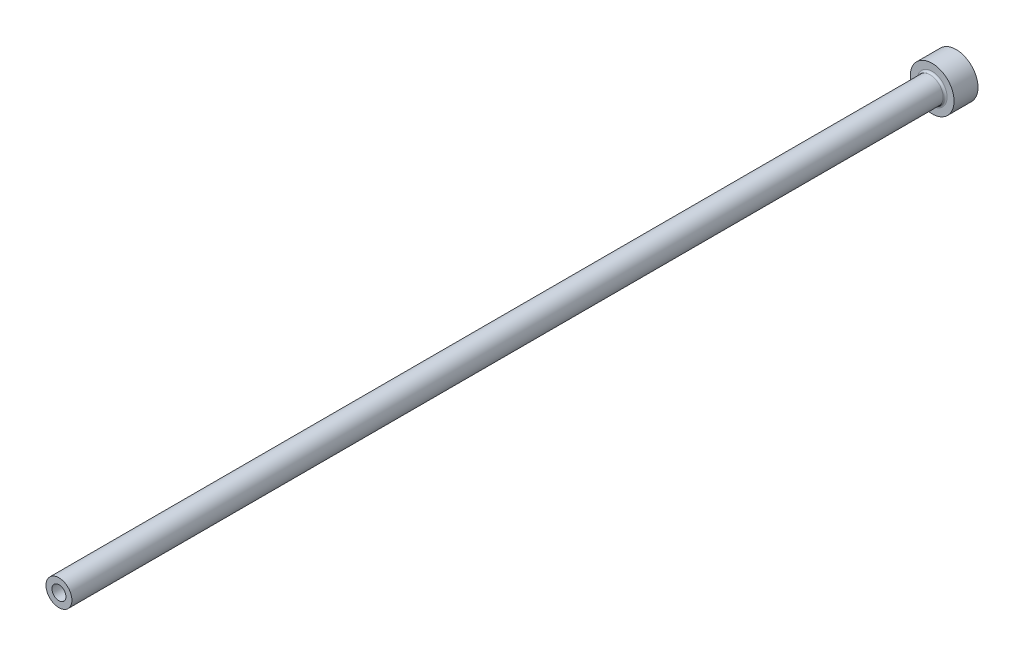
ISO-10303-21;
HEADER;
FILE_DESCRIPTION(('STEP AP214'),'2;1');
FILE_NAME('part.step','',(''),(''),'','','');
FILE_SCHEMA(('AUTOMOTIVE_DESIGN { 1 0 10303 214 1 1 1 1 }'));
ENDSEC;
DATA;
#1=APPLICATION_CONTEXT('core data for automotive mechanical design processes');
#2=APPLICATION_PROTOCOL_DEFINITION('international standard','automotive_design',2000,#1);
#3=PRODUCT_CONTEXT('',#1,'mechanical');
#4=PRODUCT('Part','Part','',(#3));
#5=PRODUCT_RELATED_PRODUCT_CATEGORY('part','',(#4));
#6=PRODUCT_DEFINITION_FORMATION('','',#4);
#7=PRODUCT_DEFINITION_CONTEXT('part definition',#1,'design');
#8=PRODUCT_DEFINITION('design','',#6,#7);
#9=PRODUCT_DEFINITION_SHAPE('','',#8);
#10=(LENGTH_UNIT() NAMED_UNIT(*) SI_UNIT(.MILLI.,.METRE.));
#11=(NAMED_UNIT(*) PLANE_ANGLE_UNIT() SI_UNIT($,.RADIAN.));
#12=(NAMED_UNIT(*) SI_UNIT($,.STERADIAN.) SOLID_ANGLE_UNIT());
#13=UNCERTAINTY_MEASURE_WITH_UNIT(LENGTH_MEASURE(1.E-05),#10,'distance_accuracy_value','');
#14=(GEOMETRIC_REPRESENTATION_CONTEXT(3) GLOBAL_UNCERTAINTY_ASSIGNED_CONTEXT((#13)) GLOBAL_UNIT_ASSIGNED_CONTEXT((#10,
#11,#12)) REPRESENTATION_CONTEXT('',''));
#15=CARTESIAN_POINT('',(0.,0.,0.));
#16=DIRECTION('',(0.,0.,1.));
#17=DIRECTION('',(1.,0.,0.));
#18=AXIS2_PLACEMENT_3D('',#15,#16,#17);
#19=CARTESIAN_POINT('',(0.,0.,225.));
#20=DIRECTION('',(0.,0.,-1.));
#21=DIRECTION('',(-1.,0.,0.));
#22=AXIS2_PLACEMENT_3D('',#19,#20,#21);
#23=PLANE('',#22);
#24=CARTESIAN_POINT('',(0.,0.,225.));
#25=DIRECTION('',(0.,0.,1.));
#26=DIRECTION('',(1.,0.,0.));
#27=AXIS2_PLACEMENT_3D('',#24,#25,#26);
#28=CIRCLE('',#27,1.74999999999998);
#29=CARTESIAN_POINT('',(1.74999999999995,0.,225.));
#30=VERTEX_POINT('',#29);
#31=EDGE_CURVE('E63',#30,#30,#28,.T.);
#32=ORIENTED_EDGE('',*,*,#31,.F.);
#33=EDGE_LOOP('',(#32));
#34=FACE_BOUND('',#33,.T.);
#35=CARTESIAN_POINT('',(0.,0.,225.));
#36=DIRECTION('',(0.,0.,1.));
#37=DIRECTION('',(1.,0.,0.));
#38=AXIS2_PLACEMENT_3D('',#35,#36,#37);
#39=CIRCLE('',#38,3.24999999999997);
#40=CARTESIAN_POINT('',(3.24999999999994,0.,225.));
#41=VERTEX_POINT('',#40);
#42=EDGE_CURVE('E54',#41,#41,#39,.T.);
#43=ORIENTED_EDGE('',*,*,#42,.T.);
#44=EDGE_LOOP('',(#43));
#45=FACE_BOUND('',#44,.T.);
#46=ADVANCED_FACE('F34',(#34,#45),#23,.F.);
#47=CARTESIAN_POINT('',(0.,0.,225.));
#48=DIRECTION('',(0.,0.,1.));
#49=DIRECTION('',(1.,0.,0.));
#50=AXIS2_PLACEMENT_3D('',#47,#48,#49);
#51=CYLINDRICAL_SURFACE('',#50,3.24999999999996);
#52=CARTESIAN_POINT('',(0.,0.,6.50000000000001));
#53=DIRECTION('',(0.,0.,1.));
#54=DIRECTION('',(1.,0.,0.));
#55=AXIS2_PLACEMENT_3D('',#52,#53,#54);
#56=CIRCLE('',#55,3.24999999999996);
#57=CARTESIAN_POINT('',(3.24999999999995,0.,6.50000000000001));
#58=VERTEX_POINT('',#57);
#59=EDGE_CURVE('E49',#58,#58,#56,.T.);
#60=ORIENTED_EDGE('',*,*,#59,.T.);
#61=EDGE_LOOP('',(#60));
#62=FACE_BOUND('',#61,.T.);
#63=ORIENTED_EDGE('',*,*,#42,.F.);
#64=EDGE_LOOP('',(#63));
#65=FACE_BOUND('',#64,.T.);
#66=ADVANCED_FACE('F92',(#62,#65),#51,.T.);
#67=CARTESIAN_POINT('',(0.,0.,6.));
#68=DIRECTION('',(0.,0.,1.));
#69=DIRECTION('',(1.,0.,0.));
#70=AXIS2_PLACEMENT_3D('',#67,#68,#69);
#71=PLANE('',#70);
#72=CARTESIAN_POINT('',(0.,0.,6.));
#73=DIRECTION('',(0.,0.,1.));
#74=DIRECTION('',(1.,0.,0.));
#75=AXIS2_PLACEMENT_3D('',#72,#73,#74);
#76=CIRCLE('',#75,3.74999999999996);
#77=CARTESIAN_POINT('',(3.74999999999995,0.,6.));
#78=VERTEX_POINT('',#77);
#79=EDGE_CURVE('E45',#78,#78,#76,.F.);
#80=ORIENTED_EDGE('',*,*,#79,.T.);
#81=EDGE_LOOP('',(#80));
#82=FACE_BOUND('',#81,.T.);
#83=CARTESIAN_POINT('',(0.,0.,6.00000000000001));
#84=DIRECTION('',(0.,0.,1.));
#85=DIRECTION('',(1.,0.,0.));
#86=AXIS2_PLACEMENT_3D('',#83,#84,#85);
#87=CIRCLE('',#86,5.49999999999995);
#88=CARTESIAN_POINT('',(5.49999999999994,0.,6.00000000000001));
#89=VERTEX_POINT('',#88);
#90=EDGE_CURVE('E57',#89,#89,#87,.T.);
#91=ORIENTED_EDGE('',*,*,#90,.T.);
#92=EDGE_LOOP('',(#91));
#93=FACE_BOUND('',#92,.T.);
#94=ADVANCED_FACE('F98',(#82,#93),#71,.T.);
#95=CARTESIAN_POINT('',(0.,0.,225.));
#96=DIRECTION('',(0.,0.,1.));
#97=DIRECTION('',(1.,0.,0.));
#98=AXIS2_PLACEMENT_3D('',#95,#96,#97);
#99=CYLINDRICAL_SURFACE('',#98,5.49999999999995);
#100=ORIENTED_EDGE('',*,*,#90,.F.);
#101=EDGE_LOOP('',(#100));
#102=FACE_BOUND('',#101,.T.);
#103=CARTESIAN_POINT('',(0.,0.,0.));
#104=DIRECTION('',(0.,0.,1.));
#105=DIRECTION('',(1.,0.,0.));
#106=AXIS2_PLACEMENT_3D('',#103,#104,#105);
#107=CIRCLE('',#106,5.49999999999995);
#108=CARTESIAN_POINT('',(5.49999999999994,0.,0.));
#109=VERTEX_POINT('',#108);
#110=EDGE_CURVE('E60',#109,#109,#107,.T.);
#111=ORIENTED_EDGE('',*,*,#110,.T.);
#112=EDGE_LOOP('',(#111));
#113=FACE_BOUND('',#112,.T.);
#114=ADVANCED_FACE('F89',(#102,#113),#99,.T.);
#115=CARTESIAN_POINT('',(0.,0.,0.));
#116=DIRECTION('',(0.,0.,1.));
#117=DIRECTION('',(1.,0.,0.));
#118=AXIS2_PLACEMENT_3D('',#115,#116,#117);
#119=PLANE('',#118);
#120=CARTESIAN_POINT('',(0.,0.,0.));
#121=DIRECTION('',(0.,0.,1.));
#122=DIRECTION('',(1.,0.,0.));
#123=AXIS2_PLACEMENT_3D('',#120,#121,#122);
#124=CIRCLE('',#123,2.49999999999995);
#125=CARTESIAN_POINT('',(2.49999999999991,0.,0.));
#126=VERTEX_POINT('',#125);
#127=EDGE_CURVE('E41',#126,#126,#124,.T.);
#128=ORIENTED_EDGE('',*,*,#127,.T.);
#129=EDGE_LOOP('',(#128));
#130=FACE_BOUND('',#129,.T.);
#131=ORIENTED_EDGE('',*,*,#110,.F.);
#132=EDGE_LOOP('',(#131));
#133=FACE_BOUND('',#132,.T.);
#134=ADVANCED_FACE('F83',(#130,#133),#119,.F.);
#135=CARTESIAN_POINT('',(0.,0.,225.));
#136=DIRECTION('',(0.,0.,1.));
#137=DIRECTION('',(1.,0.,0.));
#138=AXIS2_PLACEMENT_3D('',#135,#136,#137);
#139=CYLINDRICAL_SURFACE('',#138,1.74999999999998);
#140=ORIENTED_EDGE('',*,*,#31,.T.);
#141=EDGE_LOOP('',(#140));
#142=FACE_BOUND('',#141,.T.);
#143=CARTESIAN_POINT('',(0.,0.,125.));
#144=DIRECTION('',(0.,0.,1.));
#145=DIRECTION('',(1.,0.,0.));
#146=AXIS2_PLACEMENT_3D('',#143,#144,#145);
#147=CIRCLE('',#146,1.74999999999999);
#148=CARTESIAN_POINT('',(1.74999999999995,0.,125.));
#149=VERTEX_POINT('',#148);
#150=EDGE_CURVE('E66',#149,#149,#147,.T.);
#151=ORIENTED_EDGE('',*,*,#150,.F.);
#152=EDGE_LOOP('',(#151));
#153=FACE_BOUND('',#152,.T.);
#154=ADVANCED_FACE('F78',(#142,#153),#139,.F.);
#155=CARTESIAN_POINT('',(0.,0.,125.));
#156=DIRECTION('',(0.,0.,-1.));
#157=DIRECTION('',(-1.,0.,0.));
#158=AXIS2_PLACEMENT_3D('',#155,#156,#157);
#159=CONICAL_SURFACE('',#158,1.74999999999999,0.523598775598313);
#160=CARTESIAN_POINT('',(0.,0.,124.566987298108));
#161=DIRECTION('',(0.,0.,1.));
#162=DIRECTION('',(1.,0.,0.));
#163=AXIS2_PLACEMENT_3D('',#160,#161,#162);
#164=CIRCLE('',#163,1.99999999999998);
#165=CARTESIAN_POINT('',(1.99999999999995,0.,124.566987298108));
#166=VERTEX_POINT('',#165);
#167=EDGE_CURVE('E69',#166,#166,#164,.T.);
#168=ORIENTED_EDGE('',*,*,#167,.F.);
#169=EDGE_LOOP('',(#168));
#170=FACE_BOUND('',#169,.T.);
#171=ORIENTED_EDGE('',*,*,#150,.T.);
#172=EDGE_LOOP('',(#171));
#173=FACE_BOUND('',#172,.T.);
#174=ADVANCED_FACE('F75',(#170,#173),#159,.F.);
#175=CARTESIAN_POINT('',(0.,0.,225.));
#176=DIRECTION('',(0.,0.,1.));
#177=DIRECTION('',(1.,0.,0.));
#178=AXIS2_PLACEMENT_3D('',#175,#176,#177);
#179=CYLINDRICAL_SURFACE('',#178,1.99999999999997);
#180=CARTESIAN_POINT('',(0.,0.,0.5));
#181=DIRECTION('',(0.,0.,1.));
#182=DIRECTION('',(1.,0.,0.));
#183=AXIS2_PLACEMENT_3D('',#180,#181,#182);
#184=CIRCLE('',#183,1.99999999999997);
#185=CARTESIAN_POINT('',(1.99999999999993,0.,0.5));
#186=VERTEX_POINT('',#185);
#187=EDGE_CURVE('E10',#186,#186,#184,.F.);
#188=ORIENTED_EDGE('',*,*,#187,.T.);
#189=EDGE_LOOP('',(#188));
#190=FACE_BOUND('',#189,.T.);
#191=ORIENTED_EDGE('',*,*,#167,.T.);
#192=EDGE_LOOP('',(#191));
#193=FACE_BOUND('',#192,.T.);
#194=ADVANCED_FACE('F73',(#190,#193),#179,.F.);
#195=CARTESIAN_POINT('',(0.,0.,6.50000000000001));
#196=DIRECTION('',(0.,0.,1.));
#197=DIRECTION('',(1.,0.,0.));
#198=AXIS2_PLACEMENT_3D('',#195,#196,#197);
#199=TOROIDAL_SURFACE('',#198,3.74999999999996,0.5);
#200=ORIENTED_EDGE('',*,*,#79,.F.);
#201=EDGE_LOOP('',(#200));
#202=FACE_BOUND('',#201,.T.);
#203=ORIENTED_EDGE('',*,*,#59,.F.);
#204=EDGE_LOOP('',(#203));
#205=FACE_BOUND('',#204,.T.);
#206=ADVANCED_FACE('F104',(#202,#205),#199,.F.);
#207=CARTESIAN_POINT('',(0.,0.,0.));
#208=DIRECTION('',(0.,0.,-1.));
#209=DIRECTION('',(-1.,0.,0.));
#210=AXIS2_PLACEMENT_3D('',#207,#208,#209);
#211=CONICAL_SURFACE('',#210,2.49999999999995,0.785398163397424);
#212=ORIENTED_EDGE('',*,*,#187,.F.);
#213=EDGE_LOOP('',(#212));
#214=FACE_BOUND('',#213,.T.);
#215=ORIENTED_EDGE('',*,*,#127,.F.);
#216=EDGE_LOOP('',(#215));
#217=FACE_BOUND('',#216,.T.);
#218=ADVANCED_FACE('F36',(#214,#217),#211,.F.);
#219=CLOSED_SHELL('',(#46,#66,#94,#114,#134,#154,#174,#194,#206,#218));
#220=MANIFOLD_SOLID_BREP('B2',#219);
#221=ADVANCED_BREP_SHAPE_REPRESENTATION('',(#18,#220),#14);
#222=SHAPE_DEFINITION_REPRESENTATION(#9,#221);
ENDSEC;
END-ISO-10303-21;
